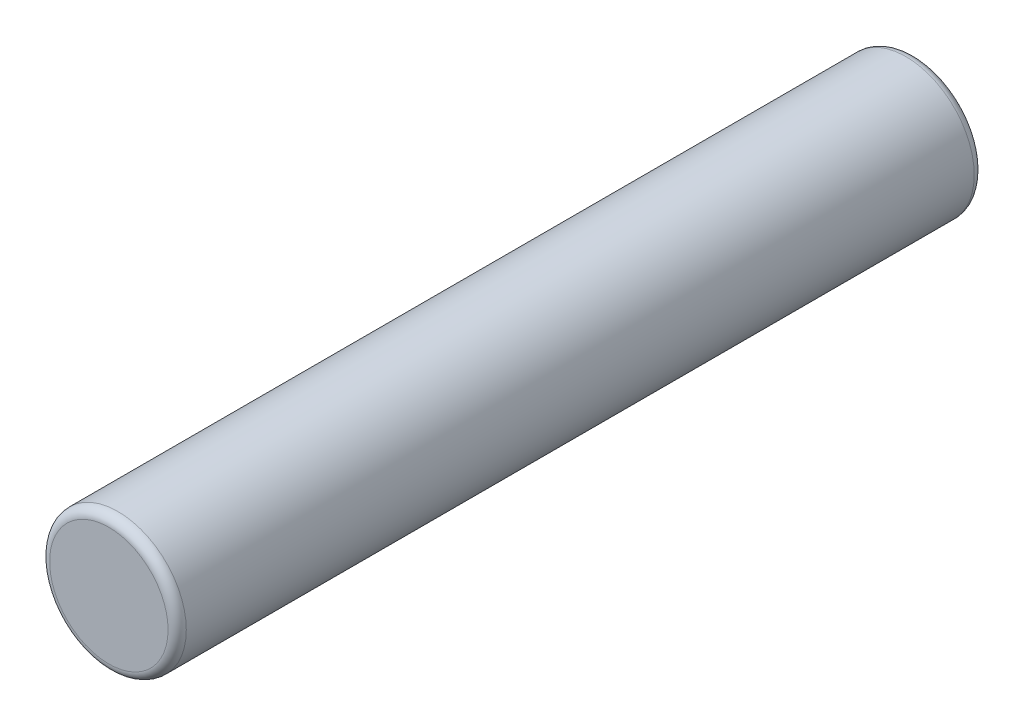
from build123d import *

# Parameters (mm, degrees)
SKETCH1_R           = 1.5
BOSS_EXTRUDE1_DEPTH = 17.7
FILLET1_R           = 0.2


with BuildPart() as part:
    # Sketch1 → Boss-Extrude1 (new body)
    with BuildSketch(Plane.XY):
        Circle(SKETCH1_R)
    extrude(amount=BOSS_EXTRUDE1_DEPTH)

    # Fillet1
    fillet1_edges = [part.edges().sort_by_distance(p)[0] for p in [
        (-1.5, 0, 0),
        (-1.5, 0, 17.7),
    ]]
    fillet(fillet1_edges, radius=FILLET1_R)


solid = part.part
